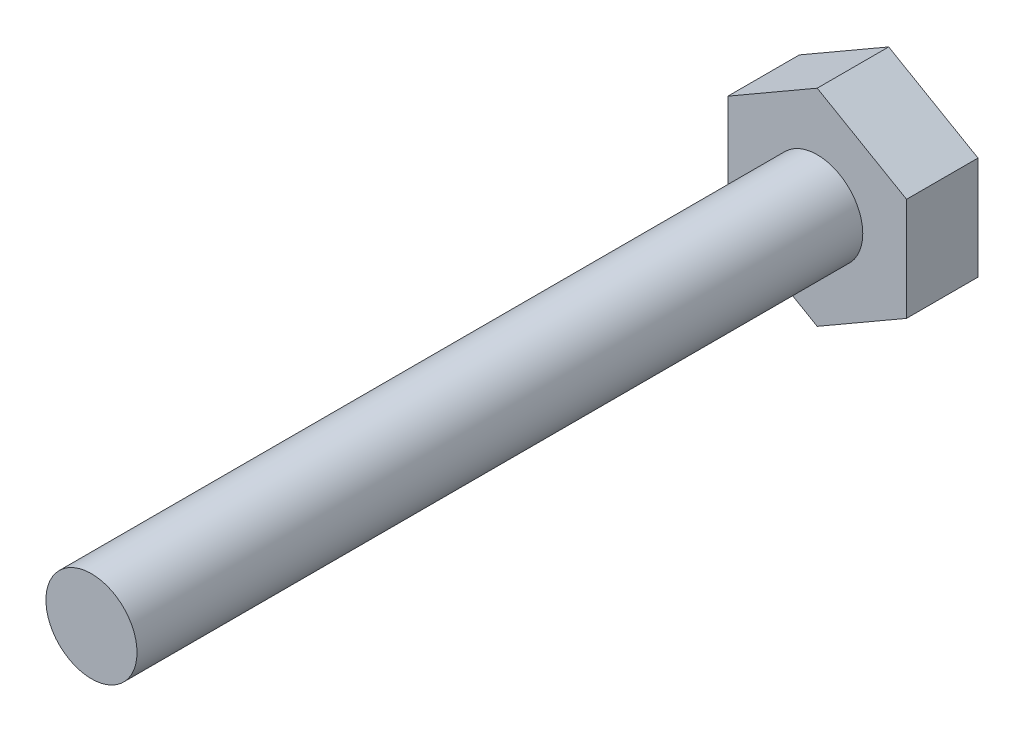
ISO-10303-21;
HEADER;
FILE_DESCRIPTION(('STEP AP214'),'2;1');
FILE_NAME('part.step','',(''),(''),'','','');
FILE_SCHEMA(('AUTOMOTIVE_DESIGN { 1 0 10303 214 1 1 1 1 }'));
ENDSEC;
DATA;
#1=APPLICATION_CONTEXT('core data for automotive mechanical design processes');
#2=APPLICATION_PROTOCOL_DEFINITION('international standard','automotive_design',2000,#1);
#3=PRODUCT_CONTEXT('',#1,'mechanical');
#4=PRODUCT('Part','Part','',(#3));
#5=PRODUCT_RELATED_PRODUCT_CATEGORY('part','',(#4));
#6=PRODUCT_DEFINITION_FORMATION('','',#4);
#7=PRODUCT_DEFINITION_CONTEXT('part definition',#1,'design');
#8=PRODUCT_DEFINITION('design','',#6,#7);
#9=PRODUCT_DEFINITION_SHAPE('','',#8);
#10=(LENGTH_UNIT() NAMED_UNIT(*) SI_UNIT(.MILLI.,.METRE.));
#11=(NAMED_UNIT(*) PLANE_ANGLE_UNIT() SI_UNIT($,.RADIAN.));
#12=(NAMED_UNIT(*) SI_UNIT($,.STERADIAN.) SOLID_ANGLE_UNIT());
#13=UNCERTAINTY_MEASURE_WITH_UNIT(LENGTH_MEASURE(1.E-05),#10,'distance_accuracy_value','');
#14=(GEOMETRIC_REPRESENTATION_CONTEXT(3) GLOBAL_UNCERTAINTY_ASSIGNED_CONTEXT((#13)) GLOBAL_UNIT_ASSIGNED_CONTEXT((#10,
#11,#12)) REPRESENTATION_CONTEXT('',''));
#15=CARTESIAN_POINT('',(0.,0.,0.));
#16=DIRECTION('',(0.,0.,1.));
#17=DIRECTION('',(1.,0.,0.));
#18=AXIS2_PLACEMENT_3D('',#15,#16,#17);
#19=CARTESIAN_POINT('',(0.,0.,65.));
#20=DIRECTION('',(0.,0.,-1.));
#21=DIRECTION('',(-1.,0.,0.));
#22=AXIS2_PLACEMENT_3D('',#19,#20,#21);
#23=PLANE('',#22);
#24=CARTESIAN_POINT('',(0.,0.,65.));
#25=DIRECTION('',(0.,0.,1.));
#26=DIRECTION('',(1.,0.,0.));
#27=AXIS2_PLACEMENT_3D('',#24,#25,#26);
#28=CIRCLE('',#27,4.08);
#29=CARTESIAN_POINT('',(4.08,0.,65.));
#30=VERTEX_POINT('',#29);
#31=EDGE_CURVE('E11',#30,#30,#28,.T.);
#32=ORIENTED_EDGE('',*,*,#31,.T.);
#33=EDGE_LOOP('',(#32));
#34=FACE_BOUND('',#33,.T.);
#35=ADVANCED_FACE('F35',(#34),#23,.F.);
#36=CARTESIAN_POINT('',(0.,0.,65.7239594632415));
#37=DIRECTION('',(0.,0.,1.));
#38=DIRECTION('',(1.,0.,0.));
#39=AXIS2_PLACEMENT_3D('',#36,#37,#38);
#40=CYLINDRICAL_SURFACE('',#39,4.08);
#41=ORIENTED_EDGE('',*,*,#31,.F.);
#42=EDGE_LOOP('',(#41));
#43=FACE_BOUND('',#42,.T.);
#44=CARTESIAN_POINT('',(0.,0.,0.));
#45=DIRECTION('',(0.,0.,1.));
#46=DIRECTION('',(1.,0.,0.));
#47=AXIS2_PLACEMENT_3D('',#44,#45,#46);
#48=CIRCLE('',#47,4.08);
#49=CARTESIAN_POINT('',(4.08,0.,0.));
#50=VERTEX_POINT('',#49);
#51=EDGE_CURVE('E42',#50,#50,#48,.T.);
#52=ORIENTED_EDGE('',*,*,#51,.T.);
#53=EDGE_LOOP('',(#52));
#54=FACE_BOUND('',#53,.T.);
#55=ADVANCED_FACE('F137',(#43,#54),#40,.T.);
#56=CARTESIAN_POINT('',(-8.,4.61880215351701,24.4404037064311));
#57=DIRECTION('',(1.,0.,0.));
#58=DIRECTION('',(0.,0.,-1.));
#59=AXIS2_PLACEMENT_3D('',#56,#57,#58);
#60=PLANE('',#59);
#61=DIRECTION('',(0.,-1.,0.));
#62=VECTOR('',#61,1.);
#63=CARTESIAN_POINT('',(-8.,4.61880215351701,0.));
#64=LINE('',#63,#62);
#65=CARTESIAN_POINT('',(-8.,4.61880215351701,0.));
#66=VERTEX_POINT('',#65);
#67=CARTESIAN_POINT('',(-8.,-4.618802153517,0.));
#68=VERTEX_POINT('',#67);
#69=EDGE_CURVE('E119',#66,#68,#64,.T.);
#70=ORIENTED_EDGE('',*,*,#69,.F.);
#71=DIRECTION('',(0.,0.,-1.));
#72=VECTOR('',#71,1.);
#73=CARTESIAN_POINT('',(-8.,4.61880215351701,24.4404037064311));
#74=LINE('',#73,#72);
#75=CARTESIAN_POINT('',(-8.,4.61880215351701,-6.4));
#76=VERTEX_POINT('',#75);
#77=EDGE_CURVE('E49',#66,#76,#74,.T.);
#78=ORIENTED_EDGE('',*,*,#77,.T.);
#79=DIRECTION('',(0.,-1.,0.));
#80=VECTOR('',#79,1.);
#81=CARTESIAN_POINT('',(-8.,4.61880215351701,-6.4));
#82=LINE('',#81,#80);
#83=CARTESIAN_POINT('',(-8.,-4.618802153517,-6.4));
#84=VERTEX_POINT('',#83);
#85=EDGE_CURVE('E127',#76,#84,#82,.T.);
#86=ORIENTED_EDGE('',*,*,#85,.T.);
#87=DIRECTION('',(0.,0.,-1.));
#88=VECTOR('',#87,1.);
#89=CARTESIAN_POINT('',(-8.,-4.618802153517,24.4404037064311));
#90=LINE('',#89,#88);
#91=EDGE_CURVE('E80',#68,#84,#90,.T.);
#92=ORIENTED_EDGE('',*,*,#91,.F.);
#93=EDGE_LOOP('',(#70,#78,#86,#92));
#94=FACE_BOUND('',#93,.T.);
#95=ADVANCED_FACE('F154',(#94),#60,.F.);
#96=CARTESIAN_POINT('',(-8.,-4.618802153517,24.4404037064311));
#97=DIRECTION('',(0.5,0.866025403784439,0.));
#98=DIRECTION('',(-0.866025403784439,0.5,0.));
#99=AXIS2_PLACEMENT_3D('',#96,#97,#98);
#100=PLANE('',#99);
#101=DIRECTION('',(0.866025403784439,-0.5,0.));
#102=VECTOR('',#101,1.);
#103=CARTESIAN_POINT('',(-8.,-4.618802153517,0.));
#104=LINE('',#103,#102);
#105=CARTESIAN_POINT('',(0.,-9.23760430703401,0.));
#106=VERTEX_POINT('',#105);
#107=EDGE_CURVE('E87',#68,#106,#104,.T.);
#108=ORIENTED_EDGE('',*,*,#107,.F.);
#109=ORIENTED_EDGE('',*,*,#91,.T.);
#110=DIRECTION('',(0.866025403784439,-0.5,0.));
#111=VECTOR('',#110,1.);
#112=CARTESIAN_POINT('',(-8.,-4.618802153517,-6.4));
#113=LINE('',#112,#111);
#114=CARTESIAN_POINT('',(0.,-9.23760430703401,-6.4));
#115=VERTEX_POINT('',#114);
#116=EDGE_CURVE('E126',#84,#115,#113,.T.);
#117=ORIENTED_EDGE('',*,*,#116,.T.);
#118=DIRECTION('',(0.,0.,-1.));
#119=VECTOR('',#118,1.);
#120=CARTESIAN_POINT('',(0.,-9.23760430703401,24.4404037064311));
#121=LINE('',#120,#119);
#122=EDGE_CURVE('E128',#106,#115,#121,.T.);
#123=ORIENTED_EDGE('',*,*,#122,.F.);
#124=EDGE_LOOP('',(#108,#109,#117,#123));
#125=FACE_BOUND('',#124,.T.);
#126=ADVANCED_FACE('F160',(#125),#100,.F.);
#127=CARTESIAN_POINT('',(0.,-9.23760430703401,24.4404037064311));
#128=DIRECTION('',(-0.5,0.866025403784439,0.));
#129=DIRECTION('',(-0.866025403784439,-0.5,0.));
#130=AXIS2_PLACEMENT_3D('',#127,#128,#129);
#131=PLANE('',#130);
#132=DIRECTION('',(0.866025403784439,0.5,0.));
#133=VECTOR('',#132,1.);
#134=CARTESIAN_POINT('',(0.,-9.23760430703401,0.));
#135=LINE('',#134,#133);
#136=CARTESIAN_POINT('',(8.,-4.61880215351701,0.));
#137=VERTEX_POINT('',#136);
#138=EDGE_CURVE('E113',#106,#137,#135,.T.);
#139=ORIENTED_EDGE('',*,*,#138,.F.);
#140=ORIENTED_EDGE('',*,*,#122,.T.);
#141=DIRECTION('',(0.866025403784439,0.5,0.));
#142=VECTOR('',#141,1.);
#143=CARTESIAN_POINT('',(0.,-9.23760430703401,-6.4));
#144=LINE('',#143,#142);
#145=CARTESIAN_POINT('',(8.,-4.61880215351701,-6.4));
#146=VERTEX_POINT('',#145);
#147=EDGE_CURVE('E130',#115,#146,#144,.T.);
#148=ORIENTED_EDGE('',*,*,#147,.T.);
#149=DIRECTION('',(0.,0.,-1.));
#150=VECTOR('',#149,1.);
#151=CARTESIAN_POINT('',(8.,-4.61880215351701,24.4404037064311));
#152=LINE('',#151,#150);
#153=EDGE_CURVE('E131',#137,#146,#152,.T.);
#154=ORIENTED_EDGE('',*,*,#153,.F.);
#155=EDGE_LOOP('',(#139,#140,#148,#154));
#156=FACE_BOUND('',#155,.T.);
#157=ADVANCED_FACE('F165',(#156),#131,.F.);
#158=CARTESIAN_POINT('',(8.,-4.61880215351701,24.4404037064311));
#159=DIRECTION('',(-1.,0.,0.));
#160=DIRECTION('',(0.,0.,1.));
#161=AXIS2_PLACEMENT_3D('',#158,#159,#160);
#162=PLANE('',#161);
#163=DIRECTION('',(0.,1.,0.));
#164=VECTOR('',#163,1.);
#165=CARTESIAN_POINT('',(8.,-4.61880215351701,0.));
#166=LINE('',#165,#164);
#167=CARTESIAN_POINT('',(8.,4.618802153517,0.));
#168=VERTEX_POINT('',#167);
#169=EDGE_CURVE('E101',#137,#168,#166,.T.);
#170=ORIENTED_EDGE('',*,*,#169,.F.);
#171=ORIENTED_EDGE('',*,*,#153,.T.);
#172=DIRECTION('',(0.,1.,0.));
#173=VECTOR('',#172,1.);
#174=CARTESIAN_POINT('',(8.,-4.61880215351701,-6.4));
#175=LINE('',#174,#173);
#176=CARTESIAN_POINT('',(8.,4.618802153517,-6.4));
#177=VERTEX_POINT('',#176);
#178=EDGE_CURVE('E107',#146,#177,#175,.T.);
#179=ORIENTED_EDGE('',*,*,#178,.T.);
#180=DIRECTION('',(0.,0.,-1.));
#181=VECTOR('',#180,1.);
#182=CARTESIAN_POINT('',(8.,4.618802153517,24.4404037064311));
#183=LINE('',#182,#181);
#184=EDGE_CURVE('E96',#168,#177,#183,.T.);
#185=ORIENTED_EDGE('',*,*,#184,.F.);
#186=EDGE_LOOP('',(#170,#171,#179,#185));
#187=FACE_BOUND('',#186,.T.);
#188=ADVANCED_FACE('F104',(#187),#162,.F.);
#189=CARTESIAN_POINT('',(8.,4.618802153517,24.4404037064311));
#190=DIRECTION('',(-0.5,-0.866025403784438,0.));
#191=DIRECTION('',(0.866025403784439,-0.5,0.));
#192=AXIS2_PLACEMENT_3D('',#189,#190,#191);
#193=PLANE('',#192);
#194=DIRECTION('',(-0.866025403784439,0.5,0.));
#195=VECTOR('',#194,1.);
#196=CARTESIAN_POINT('',(8.,4.618802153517,0.));
#197=LINE('',#196,#195);
#198=CARTESIAN_POINT('',(0.,9.23760430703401,0.));
#199=VERTEX_POINT('',#198);
#200=EDGE_CURVE('E93',#168,#199,#197,.T.);
#201=ORIENTED_EDGE('',*,*,#200,.F.);
#202=ORIENTED_EDGE('',*,*,#184,.T.);
#203=DIRECTION('',(-0.866025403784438,0.5,0.));
#204=VECTOR('',#203,1.);
#205=CARTESIAN_POINT('',(8.,4.618802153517,-6.4));
#206=LINE('',#205,#204);
#207=CARTESIAN_POINT('',(0.,9.23760430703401,-6.4));
#208=VERTEX_POINT('',#207);
#209=EDGE_CURVE('E109',#177,#208,#206,.T.);
#210=ORIENTED_EDGE('',*,*,#209,.T.);
#211=DIRECTION('',(0.,0.,-1.));
#212=VECTOR('',#211,1.);
#213=CARTESIAN_POINT('',(0.,9.23760430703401,24.4404037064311));
#214=LINE('',#213,#212);
#215=EDGE_CURVE('E55',#199,#208,#214,.T.);
#216=ORIENTED_EDGE('',*,*,#215,.F.);
#217=EDGE_LOOP('',(#201,#202,#210,#216));
#218=FACE_BOUND('',#217,.T.);
#219=ADVANCED_FACE('F95',(#218),#193,.F.);
#220=CARTESIAN_POINT('',(0.,9.23760430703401,24.4404037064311));
#221=DIRECTION('',(0.5,-0.866025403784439,0.));
#222=DIRECTION('',(0.866025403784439,0.5,0.));
#223=AXIS2_PLACEMENT_3D('',#220,#221,#222);
#224=PLANE('',#223);
#225=DIRECTION('',(-0.866025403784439,-0.5,0.));
#226=VECTOR('',#225,1.);
#227=CARTESIAN_POINT('',(0.,9.23760430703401,0.));
#228=LINE('',#227,#226);
#229=EDGE_CURVE('E122',#199,#66,#228,.T.);
#230=ORIENTED_EDGE('',*,*,#229,.F.);
#231=ORIENTED_EDGE('',*,*,#215,.T.);
#232=DIRECTION('',(-0.866025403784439,-0.5,0.));
#233=VECTOR('',#232,1.);
#234=CARTESIAN_POINT('',(0.,9.23760430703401,-6.4));
#235=LINE('',#234,#233);
#236=EDGE_CURVE('E124',#208,#76,#235,.T.);
#237=ORIENTED_EDGE('',*,*,#236,.T.);
#238=ORIENTED_EDGE('',*,*,#77,.F.);
#239=EDGE_LOOP('',(#230,#231,#237,#238));
#240=FACE_BOUND('',#239,.T.);
#241=ADVANCED_FACE('F145',(#240),#224,.F.);
#242=CARTESIAN_POINT('',(-8.,-13.856406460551,-6.4));
#243=DIRECTION('',(0.,0.,1.));
#244=DIRECTION('',(1.,0.,0.));
#245=AXIS2_PLACEMENT_3D('',#242,#243,#244);
#246=PLANE('',#245);
#247=ORIENTED_EDGE('',*,*,#85,.F.);
#248=ORIENTED_EDGE('',*,*,#236,.F.);
#249=ORIENTED_EDGE('',*,*,#209,.F.);
#250=ORIENTED_EDGE('',*,*,#178,.F.);
#251=ORIENTED_EDGE('',*,*,#147,.F.);
#252=ORIENTED_EDGE('',*,*,#116,.F.);
#253=EDGE_LOOP('',(#247,#248,#249,#250,#251,#252));
#254=FACE_BOUND('',#253,.T.);
#255=ADVANCED_FACE('F140',(#254),#246,.F.);
#256=CARTESIAN_POINT('',(0.,0.,0.));
#257=DIRECTION('',(0.,0.,1.));
#258=DIRECTION('',(1.,0.,0.));
#259=AXIS2_PLACEMENT_3D('',#256,#257,#258);
#260=PLANE('',#259);
#261=ORIENTED_EDGE('',*,*,#51,.F.);
#262=EDGE_LOOP('',(#261));
#263=FACE_BOUND('',#262,.T.);
#264=ORIENTED_EDGE('',*,*,#229,.T.);
#265=ORIENTED_EDGE('',*,*,#69,.T.);
#266=ORIENTED_EDGE('',*,*,#107,.T.);
#267=ORIENTED_EDGE('',*,*,#138,.T.);
#268=ORIENTED_EDGE('',*,*,#169,.T.);
#269=ORIENTED_EDGE('',*,*,#200,.T.);
#270=EDGE_LOOP('',(#264,#265,#266,#267,#268,#269));
#271=FACE_BOUND('',#270,.T.);
#272=ADVANCED_FACE('F112',(#263,#271),#260,.T.);
#273=CLOSED_SHELL('',(#35,#55,#95,#126,#157,#188,#219,#241,#255,#272));
#274=MANIFOLD_SOLID_BREP('B2',#273);
#275=ADVANCED_BREP_SHAPE_REPRESENTATION('',(#18,#274),#14);
#276=SHAPE_DEFINITION_REPRESENTATION(#9,#275);
ENDSEC;
END-ISO-10303-21;
